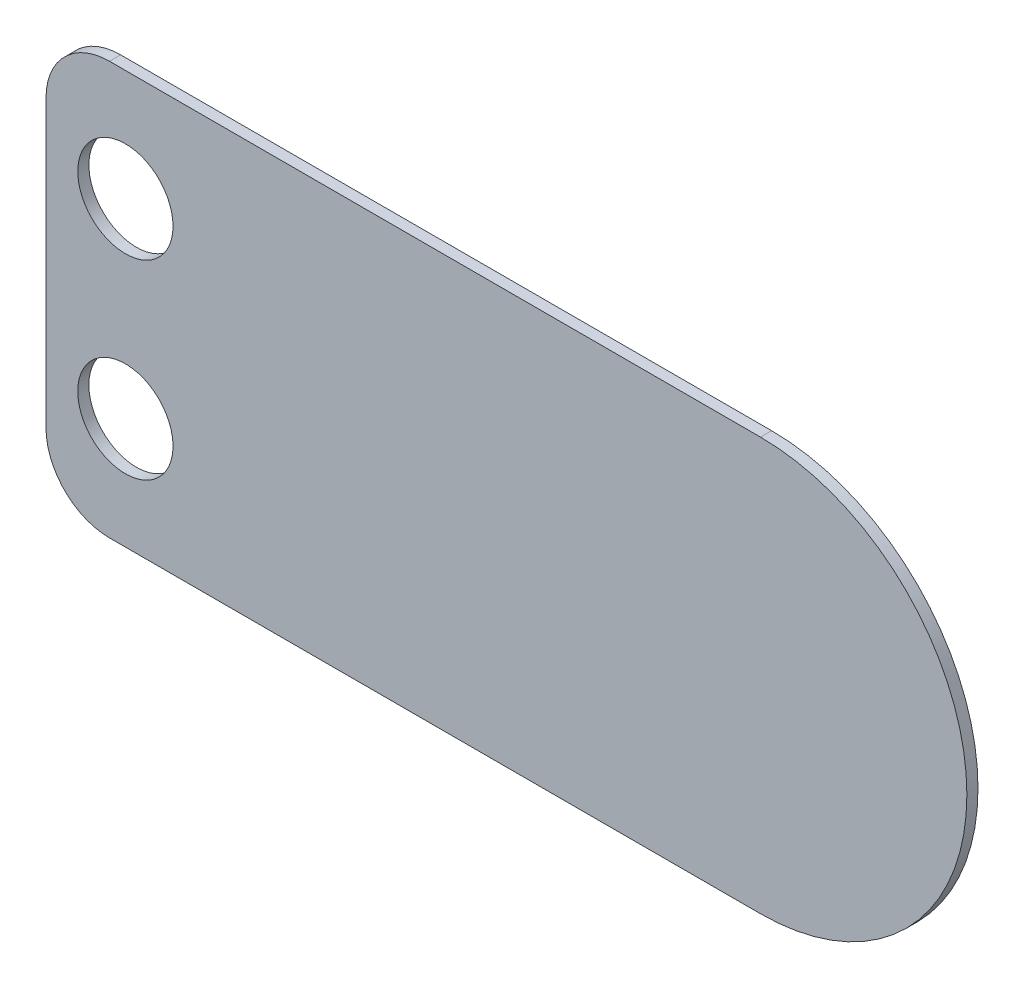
from build123d import *

# Parameters (mm, degrees)
ESQUISSE1_R          = 1.5
BASE_EXTRUSION_DEPTH = 0.35
CONG_1_R             = 2


with BuildPart() as part:
    # Esquisse1 → Base-Extrusion (new body)
    with BuildSketch(Plane.XY):
        with BuildLine():
            Line((0, 6.5), (-22.5, 6.5))
            Line((-22.5, 6.5), (-22.5, -6.5))
            Line((-22.5, -6.5), (0, -6.5))
            ThreePointArc((0, -6.5), (6.5, 0), (0, 6.5))
        make_face()
        with Locations((-20, 3)):
            Circle(ESQUISSE1_R, mode=Mode.SUBTRACT)
        with Locations(Location((-20, -3, 0), (0, 0, 180))):
            Circle(ESQUISSE1_R, mode=Mode.SUBTRACT)
    extrude(amount=BASE_EXTRUSION_DEPTH)

    # Cong_1
    cong_1_edges = [part.edges().sort_by_distance(p)[0] for p in [
        (-22.5, 6.5, 0.175),
        (-22.5, -6.5, 0.175),
    ]]
    fillet(cong_1_edges, radius=CONG_1_R)


solid = part.part
